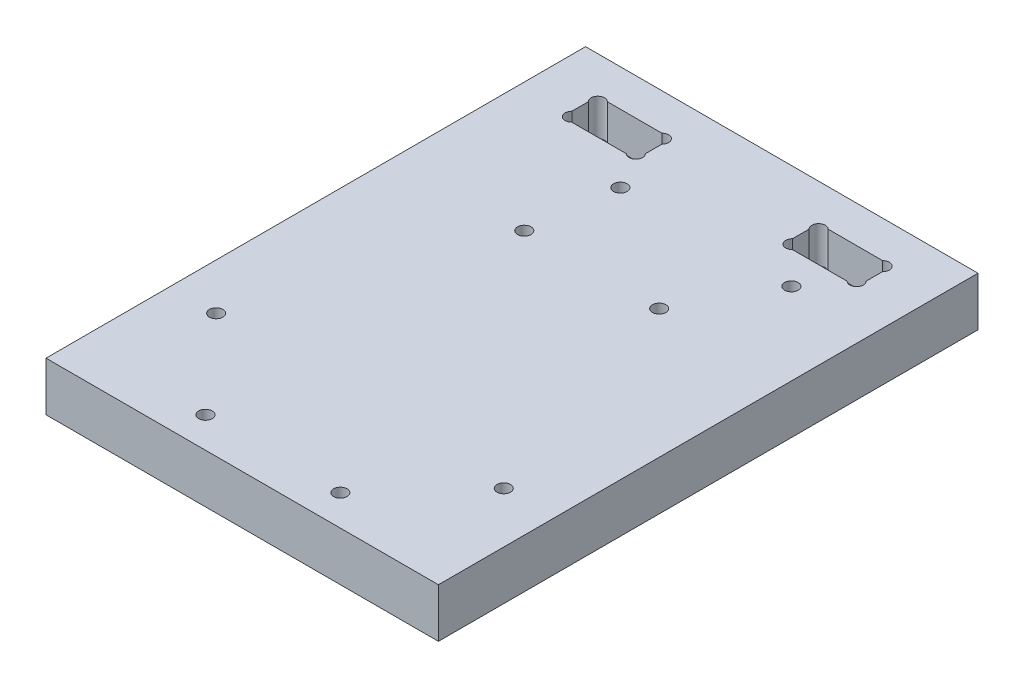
ISO-10303-21;
HEADER;
FILE_DESCRIPTION(('STEP AP214'),'2;1');
FILE_NAME('part.step','',(''),(''),'','','');
FILE_SCHEMA(('AUTOMOTIVE_DESIGN { 1 0 10303 214 1 1 1 1 }'));
ENDSEC;
DATA;
#1=APPLICATION_CONTEXT('core data for automotive mechanical design processes');
#2=APPLICATION_PROTOCOL_DEFINITION('international standard','automotive_design',2000,#1);
#3=PRODUCT_CONTEXT('',#1,'mechanical');
#4=PRODUCT('Part','Part','',(#3));
#5=PRODUCT_RELATED_PRODUCT_CATEGORY('part','',(#4));
#6=PRODUCT_DEFINITION_FORMATION('','',#4);
#7=PRODUCT_DEFINITION_CONTEXT('part definition',#1,'design');
#8=PRODUCT_DEFINITION('design','',#6,#7);
#9=PRODUCT_DEFINITION_SHAPE('','',#8);
#10=(LENGTH_UNIT() NAMED_UNIT(*) SI_UNIT(.MILLI.,.METRE.));
#11=(NAMED_UNIT(*) PLANE_ANGLE_UNIT() SI_UNIT($,.RADIAN.));
#12=(NAMED_UNIT(*) SI_UNIT($,.STERADIAN.) SOLID_ANGLE_UNIT());
#13=UNCERTAINTY_MEASURE_WITH_UNIT(LENGTH_MEASURE(1.E-05),#10,'distance_accuracy_value','');
#14=(GEOMETRIC_REPRESENTATION_CONTEXT(3) GLOBAL_UNCERTAINTY_ASSIGNED_CONTEXT((#13)) GLOBAL_UNIT_ASSIGNED_CONTEXT((#10,
#11,#12)) REPRESENTATION_CONTEXT('',''));
#15=CARTESIAN_POINT('',(0.,0.,0.));
#16=DIRECTION('',(0.,0.,1.));
#17=DIRECTION('',(1.,0.,0.));
#18=AXIS2_PLACEMENT_3D('',#15,#16,#17);
#19=CARTESIAN_POINT('',(23.2221825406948,8.,-32.9778174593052));
#20=DIRECTION('',(0.,-1.,0.));
#21=DIRECTION('',(0.,0.,-1.));
#22=AXIS2_PLACEMENT_3D('',#19,#20,#21);
#23=CYLINDRICAL_SURFACE('',#22,1.09999999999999);
#24=DIRECTION('',(0.,-1.,0.));
#25=VECTOR('',#24,1.);
#26=CARTESIAN_POINT('',(24.,8.,-33.7556349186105));
#27=LINE('',#26,#25);
#28=CARTESIAN_POINT('',(24.,8.,-33.7556349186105));
#29=VERTEX_POINT('',#28);
#30=CARTESIAN_POINT('',(24.,2.,-33.7556349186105));
#31=VERTEX_POINT('',#30);
#32=EDGE_CURVE('E454',#29,#31,#27,.T.);
#33=ORIENTED_EDGE('',*,*,#32,.T.);
#34=CARTESIAN_POINT('',(23.2221825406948,2.,-32.9778174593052));
#35=DIRECTION('',(0.,-1.,0.));
#36=DIRECTION('',(0.,0.,-1.));
#37=AXIS2_PLACEMENT_3D('',#34,#35,#36);
#38=CIRCLE('',#37,1.09999999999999);
#39=CARTESIAN_POINT('',(22.4443650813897,2.,-32.2));
#40=VERTEX_POINT('',#39);
#41=EDGE_CURVE('E271',#31,#40,#38,.T.);
#42=ORIENTED_EDGE('',*,*,#41,.T.);
#43=DIRECTION('',(0.,-1.,0.));
#44=VECTOR('',#43,1.);
#45=CARTESIAN_POINT('',(22.4443650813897,8.,-32.2));
#46=LINE('',#45,#44);
#47=CARTESIAN_POINT('',(22.4443650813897,8.,-32.2));
#48=VERTEX_POINT('',#47);
#49=EDGE_CURVE('E433',#48,#40,#46,.T.);
#50=ORIENTED_EDGE('',*,*,#49,.F.);
#51=CARTESIAN_POINT('',(23.2221825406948,8.,-32.9778174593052));
#52=DIRECTION('',(0.,1.,0.));
#53=DIRECTION('',(0.,0.,1.));
#54=AXIS2_PLACEMENT_3D('',#51,#52,#53);
#55=CIRCLE('',#54,1.09999999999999);
#56=EDGE_CURVE('E416',#48,#29,#55,.T.);
#57=ORIENTED_EDGE('',*,*,#56,.T.);
#58=EDGE_LOOP('',(#33,#42,#50,#57));
#59=FACE_BOUND('',#58,.T.);
#60=ADVANCED_FACE('F33',(#59),#23,.F.);
#61=CARTESIAN_POINT('',(24.,8.,-36.4443650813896));
#62=DIRECTION('',(-1.,0.,0.));
#63=DIRECTION('',(0.,0.,1.));
#64=AXIS2_PLACEMENT_3D('',#61,#62,#63);
#65=PLANE('',#64);
#66=DIRECTION('',(0.,-1.,0.));
#67=VECTOR('',#66,1.);
#68=CARTESIAN_POINT('',(24.,8.,-36.4443650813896));
#69=LINE('',#68,#67);
#70=CARTESIAN_POINT('',(24.,8.,-36.4443650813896));
#71=VERTEX_POINT('',#70);
#72=CARTESIAN_POINT('',(24.,2.,-36.4443650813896));
#73=VERTEX_POINT('',#72);
#74=EDGE_CURVE('E451',#71,#73,#69,.T.);
#75=ORIENTED_EDGE('',*,*,#74,.T.);
#76=DIRECTION('',(0.,0.,1.));
#77=VECTOR('',#76,1.);
#78=CARTESIAN_POINT('',(24.,2.,-36.4443650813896));
#79=LINE('',#78,#77);
#80=EDGE_CURVE('E268',#73,#31,#79,.T.);
#81=ORIENTED_EDGE('',*,*,#80,.T.);
#82=ORIENTED_EDGE('',*,*,#32,.F.);
#83=DIRECTION('',(0.,0.,-1.));
#84=VECTOR('',#83,1.);
#85=CARTESIAN_POINT('',(24.,8.,-36.4443650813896));
#86=LINE('',#85,#84);
#87=EDGE_CURVE('E418',#29,#71,#86,.T.);
#88=ORIENTED_EDGE('',*,*,#87,.T.);
#89=EDGE_LOOP('',(#75,#81,#82,#88));
#90=FACE_BOUND('',#89,.T.);
#91=ADVANCED_FACE('F533',(#90),#65,.T.);
#92=CARTESIAN_POINT('',(23.2221825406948,8.,-37.2221825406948));
#93=DIRECTION('',(0.,-1.,0.));
#94=DIRECTION('',(0.,0.,-1.));
#95=AXIS2_PLACEMENT_3D('',#92,#93,#94);
#96=CYLINDRICAL_SURFACE('',#95,1.09999999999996);
#97=DIRECTION('',(0.,-1.,0.));
#98=VECTOR('',#97,1.);
#99=CARTESIAN_POINT('',(22.4443650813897,8.,-38.));
#100=LINE('',#99,#98);
#101=CARTESIAN_POINT('',(22.4443650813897,8.,-38.));
#102=VERTEX_POINT('',#101);
#103=CARTESIAN_POINT('',(22.4443650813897,2.,-38.));
#104=VERTEX_POINT('',#103);
#105=EDGE_CURVE('E448',#102,#104,#100,.T.);
#106=ORIENTED_EDGE('',*,*,#105,.T.);
#107=CARTESIAN_POINT('',(23.2221825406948,2.,-37.2221825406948));
#108=DIRECTION('',(0.,-1.,0.));
#109=DIRECTION('',(0.,0.,-1.));
#110=AXIS2_PLACEMENT_3D('',#107,#108,#109);
#111=CIRCLE('',#110,1.09999999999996);
#112=EDGE_CURVE('E265',#104,#73,#111,.T.);
#113=ORIENTED_EDGE('',*,*,#112,.T.);
#114=ORIENTED_EDGE('',*,*,#74,.F.);
#115=CARTESIAN_POINT('',(23.2221825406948,8.,-37.2221825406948));
#116=DIRECTION('',(0.,1.,0.));
#117=DIRECTION('',(0.,0.,-1.));
#118=AXIS2_PLACEMENT_3D('',#115,#116,#117);
#119=CIRCLE('',#118,1.09999999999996);
#120=EDGE_CURVE('E420',#71,#102,#119,.T.);
#121=ORIENTED_EDGE('',*,*,#120,.T.);
#122=EDGE_LOOP('',(#106,#113,#114,#121));
#123=FACE_BOUND('',#122,.T.);
#124=ADVANCED_FACE('F539',(#123),#96,.F.);
#125=CARTESIAN_POINT('',(13.5556349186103,8.,-38.));
#126=DIRECTION('',(0.,0.,1.));
#127=DIRECTION('',(1.,0.,0.));
#128=AXIS2_PLACEMENT_3D('',#125,#126,#127);
#129=PLANE('',#128);
#130=DIRECTION('',(0.,-1.,0.));
#131=VECTOR('',#130,1.);
#132=CARTESIAN_POINT('',(13.5556349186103,8.,-38.));
#133=LINE('',#132,#131);
#134=CARTESIAN_POINT('',(13.5556349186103,8.,-38.));
#135=VERTEX_POINT('',#134);
#136=CARTESIAN_POINT('',(13.5556349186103,2.,-38.));
#137=VERTEX_POINT('',#136);
#138=EDGE_CURVE('E445',#135,#137,#133,.T.);
#139=ORIENTED_EDGE('',*,*,#138,.T.);
#140=DIRECTION('',(1.,0.,0.));
#141=VECTOR('',#140,1.);
#142=CARTESIAN_POINT('',(13.5556349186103,2.,-38.));
#143=LINE('',#142,#141);
#144=EDGE_CURVE('E262',#137,#104,#143,.T.);
#145=ORIENTED_EDGE('',*,*,#144,.T.);
#146=ORIENTED_EDGE('',*,*,#105,.F.);
#147=DIRECTION('',(-1.,0.,0.));
#148=VECTOR('',#147,1.);
#149=CARTESIAN_POINT('',(13.5556349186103,8.,-38.));
#150=LINE('',#149,#148);
#151=EDGE_CURVE('E422',#102,#135,#150,.T.);
#152=ORIENTED_EDGE('',*,*,#151,.T.);
#153=EDGE_LOOP('',(#139,#145,#146,#152));
#154=FACE_BOUND('',#153,.T.);
#155=ADVANCED_FACE('F590',(#154),#129,.T.);
#156=CARTESIAN_POINT('',(12.7778174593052,8.,-37.2221825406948));
#157=DIRECTION('',(0.,-1.,0.));
#158=DIRECTION('',(0.,0.,-1.));
#159=AXIS2_PLACEMENT_3D('',#156,#157,#158);
#160=CYLINDRICAL_SURFACE('',#159,1.09999999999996);
#161=DIRECTION('',(0.,-1.,0.));
#162=VECTOR('',#161,1.);
#163=CARTESIAN_POINT('',(12.,8.,-36.4443650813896));
#164=LINE('',#163,#162);
#165=CARTESIAN_POINT('',(12.,8.,-36.4443650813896));
#166=VERTEX_POINT('',#165);
#167=CARTESIAN_POINT('',(12.,2.,-36.4443650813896));
#168=VERTEX_POINT('',#167);
#169=EDGE_CURVE('E442',#166,#168,#164,.T.);
#170=ORIENTED_EDGE('',*,*,#169,.T.);
#171=CARTESIAN_POINT('',(12.7778174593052,2.,-37.2221825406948));
#172=DIRECTION('',(0.,-1.,0.));
#173=DIRECTION('',(0.,0.,-1.));
#174=AXIS2_PLACEMENT_3D('',#171,#172,#173);
#175=CIRCLE('',#174,1.09999999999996);
#176=EDGE_CURVE('E259',#168,#137,#175,.T.);
#177=ORIENTED_EDGE('',*,*,#176,.T.);
#178=ORIENTED_EDGE('',*,*,#138,.F.);
#179=CARTESIAN_POINT('',(12.7778174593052,8.,-37.2221825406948));
#180=DIRECTION('',(0.,1.,0.));
#181=DIRECTION('',(0.,0.,1.));
#182=AXIS2_PLACEMENT_3D('',#179,#180,#181);
#183=CIRCLE('',#182,1.09999999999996);
#184=EDGE_CURVE('E424',#135,#166,#183,.T.);
#185=ORIENTED_EDGE('',*,*,#184,.T.);
#186=EDGE_LOOP('',(#170,#177,#178,#185));
#187=FACE_BOUND('',#186,.T.);
#188=ADVANCED_FACE('F594',(#187),#160,.F.);
#189=CARTESIAN_POINT('',(12.,8.,-36.4443650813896));
#190=DIRECTION('',(1.,0.,0.));
#191=DIRECTION('',(0.,0.,-1.));
#192=AXIS2_PLACEMENT_3D('',#189,#190,#191);
#193=PLANE('',#192);
#194=DIRECTION('',(0.,-1.,0.));
#195=VECTOR('',#194,1.);
#196=CARTESIAN_POINT('',(12.,8.,-33.7556349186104));
#197=LINE('',#196,#195);
#198=CARTESIAN_POINT('',(12.,8.,-33.7556349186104));
#199=VERTEX_POINT('',#198);
#200=CARTESIAN_POINT('',(12.,2.,-33.7556349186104));
#201=VERTEX_POINT('',#200);
#202=EDGE_CURVE('E439',#199,#201,#197,.T.);
#203=ORIENTED_EDGE('',*,*,#202,.T.);
#204=DIRECTION('',(0.,0.,-1.));
#205=VECTOR('',#204,1.);
#206=CARTESIAN_POINT('',(12.,2.,-36.4443650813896));
#207=LINE('',#206,#205);
#208=EDGE_CURVE('E256',#201,#168,#207,.T.);
#209=ORIENTED_EDGE('',*,*,#208,.T.);
#210=ORIENTED_EDGE('',*,*,#169,.F.);
#211=DIRECTION('',(0.,0.,1.));
#212=VECTOR('',#211,1.);
#213=CARTESIAN_POINT('',(12.,8.,-36.4443650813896));
#214=LINE('',#213,#212);
#215=EDGE_CURVE('E426',#166,#199,#214,.T.);
#216=ORIENTED_EDGE('',*,*,#215,.T.);
#217=EDGE_LOOP('',(#203,#209,#210,#216));
#218=FACE_BOUND('',#217,.T.);
#219=ADVANCED_FACE('F600',(#218),#193,.T.);
#220=CARTESIAN_POINT('',(12.7778174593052,8.,-32.9778174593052));
#221=DIRECTION('',(0.,-1.,0.));
#222=DIRECTION('',(0.,0.,-1.));
#223=AXIS2_PLACEMENT_3D('',#220,#221,#222);
#224=CYLINDRICAL_SURFACE('',#223,1.09999999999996);
#225=DIRECTION('',(0.,-1.,0.));
#226=VECTOR('',#225,1.);
#227=CARTESIAN_POINT('',(13.5556349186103,8.,-32.2));
#228=LINE('',#227,#226);
#229=CARTESIAN_POINT('',(13.5556349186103,8.,-32.2));
#230=VERTEX_POINT('',#229);
#231=CARTESIAN_POINT('',(13.5556349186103,2.,-32.2));
#232=VERTEX_POINT('',#231);
#233=EDGE_CURVE('E436',#230,#232,#228,.T.);
#234=ORIENTED_EDGE('',*,*,#233,.T.);
#235=CARTESIAN_POINT('',(12.7778174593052,2.,-32.9778174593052));
#236=DIRECTION('',(0.,-1.,0.));
#237=DIRECTION('',(0.,0.,-1.));
#238=AXIS2_PLACEMENT_3D('',#235,#236,#237);
#239=CIRCLE('',#238,1.09999999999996);
#240=EDGE_CURVE('E56',#232,#201,#239,.T.);
#241=ORIENTED_EDGE('',*,*,#240,.T.);
#242=ORIENTED_EDGE('',*,*,#202,.F.);
#243=CARTESIAN_POINT('',(12.7778174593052,8.,-32.9778174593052));
#244=DIRECTION('',(0.,1.,0.));
#245=DIRECTION('',(0.,0.,-1.));
#246=AXIS2_PLACEMENT_3D('',#243,#244,#245);
#247=CIRCLE('',#246,1.09999999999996);
#248=EDGE_CURVE('E428',#199,#230,#247,.T.);
#249=ORIENTED_EDGE('',*,*,#248,.T.);
#250=EDGE_LOOP('',(#234,#241,#242,#249));
#251=FACE_BOUND('',#250,.T.);
#252=ADVANCED_FACE('F602',(#251),#224,.F.);
#253=CARTESIAN_POINT('',(13.5556349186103,8.,-32.2));
#254=DIRECTION('',(0.,0.,-1.));
#255=DIRECTION('',(-1.,0.,0.));
#256=AXIS2_PLACEMENT_3D('',#253,#254,#255);
#257=PLANE('',#256);
#258=ORIENTED_EDGE('',*,*,#49,.T.);
#259=DIRECTION('',(-1.,0.,0.));
#260=VECTOR('',#259,1.);
#261=CARTESIAN_POINT('',(13.5556349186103,2.,-32.2));
#262=LINE('',#261,#260);
#263=EDGE_CURVE('E11',#40,#232,#262,.T.);
#264=ORIENTED_EDGE('',*,*,#263,.T.);
#265=ORIENTED_EDGE('',*,*,#233,.F.);
#266=DIRECTION('',(1.,0.,0.));
#267=VECTOR('',#266,1.);
#268=CARTESIAN_POINT('',(13.5556349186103,8.,-32.2));
#269=LINE('',#268,#267);
#270=EDGE_CURVE('E431',#230,#48,#269,.T.);
#271=ORIENTED_EDGE('',*,*,#270,.T.);
#272=EDGE_LOOP('',(#258,#264,#265,#271));
#273=FACE_BOUND('',#272,.T.);
#274=ADVANCED_FACE('F604',(#273),#257,.T.);
#275=CARTESIAN_POINT('',(-12.7778174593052,8.,-37.2221825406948));
#276=DIRECTION('',(0.,-1.,0.));
#277=DIRECTION('',(0.,0.,-1.));
#278=AXIS2_PLACEMENT_3D('',#275,#276,#277);
#279=CYLINDRICAL_SURFACE('',#278,1.09999999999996);
#280=DIRECTION('',(0.,-1.,0.));
#281=VECTOR('',#280,1.);
#282=CARTESIAN_POINT('',(-13.5556349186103,8.,-38.));
#283=LINE('',#282,#281);
#284=CARTESIAN_POINT('',(-13.5556349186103,8.,-38.));
#285=VERTEX_POINT('',#284);
#286=CARTESIAN_POINT('',(-13.5556349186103,2.,-38.));
#287=VERTEX_POINT('',#286);
#288=EDGE_CURVE('E413',#285,#287,#283,.T.);
#289=ORIENTED_EDGE('',*,*,#288,.T.);
#290=CARTESIAN_POINT('',(-12.7778174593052,2.,-37.2221825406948));
#291=DIRECTION('',(0.,-1.,0.));
#292=DIRECTION('',(0.,0.,-1.));
#293=AXIS2_PLACEMENT_3D('',#290,#291,#292);
#294=CIRCLE('',#293,1.09999999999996);
#295=CARTESIAN_POINT('',(-12.,2.,-36.4443650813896));
#296=VERTEX_POINT('',#295);
#297=EDGE_CURVE('E324',#287,#296,#294,.T.);
#298=ORIENTED_EDGE('',*,*,#297,.T.);
#299=DIRECTION('',(0.,-1.,0.));
#300=VECTOR('',#299,1.);
#301=CARTESIAN_POINT('',(-12.,8.,-36.4443650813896));
#302=LINE('',#301,#300);
#303=CARTESIAN_POINT('',(-12.,8.,-36.4443650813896));
#304=VERTEX_POINT('',#303);
#305=EDGE_CURVE('E392',#304,#296,#302,.T.);
#306=ORIENTED_EDGE('',*,*,#305,.F.);
#307=CARTESIAN_POINT('',(-12.7778174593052,8.,-37.2221825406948));
#308=DIRECTION('',(0.,1.,0.));
#309=DIRECTION('',(0.,0.,-1.));
#310=AXIS2_PLACEMENT_3D('',#307,#308,#309);
#311=CIRCLE('',#310,1.09999999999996);
#312=EDGE_CURVE('E373',#304,#285,#311,.T.);
#313=ORIENTED_EDGE('',*,*,#312,.T.);
#314=EDGE_LOOP('',(#289,#298,#306,#313));
#315=FACE_BOUND('',#314,.T.);
#316=ADVANCED_FACE('F503',(#315),#279,.F.);
#317=CARTESIAN_POINT('',(-13.5556349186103,8.,-38.));
#318=DIRECTION('',(0.,0.,1.));
#319=DIRECTION('',(1.,0.,0.));
#320=AXIS2_PLACEMENT_3D('',#317,#318,#319);
#321=PLANE('',#320);
#322=DIRECTION('',(0.,-1.,0.));
#323=VECTOR('',#322,1.);
#324=CARTESIAN_POINT('',(-22.4443650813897,8.,-38.));
#325=LINE('',#324,#323);
#326=CARTESIAN_POINT('',(-22.4443650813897,8.,-38.));
#327=VERTEX_POINT('',#326);
#328=CARTESIAN_POINT('',(-22.4443650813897,2.,-38.));
#329=VERTEX_POINT('',#328);
#330=EDGE_CURVE('E410',#327,#329,#325,.T.);
#331=ORIENTED_EDGE('',*,*,#330,.T.);
#332=DIRECTION('',(1.,0.,0.));
#333=VECTOR('',#332,1.);
#334=CARTESIAN_POINT('',(-13.5556349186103,2.,-38.));
#335=LINE('',#334,#333);
#336=EDGE_CURVE('E321',#329,#287,#335,.T.);
#337=ORIENTED_EDGE('',*,*,#336,.T.);
#338=ORIENTED_EDGE('',*,*,#288,.F.);
#339=DIRECTION('',(-1.,0.,0.));
#340=VECTOR('',#339,1.);
#341=CARTESIAN_POINT('',(-13.5556349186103,8.,-38.));
#342=LINE('',#341,#340);
#343=EDGE_CURVE('E377',#285,#327,#342,.T.);
#344=ORIENTED_EDGE('',*,*,#343,.T.);
#345=EDGE_LOOP('',(#331,#337,#338,#344));
#346=FACE_BOUND('',#345,.T.);
#347=ADVANCED_FACE('F508',(#346),#321,.T.);
#348=CARTESIAN_POINT('',(-23.2221825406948,8.,-37.2221825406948));
#349=DIRECTION('',(0.,-1.,0.));
#350=DIRECTION('',(0.,0.,-1.));
#351=AXIS2_PLACEMENT_3D('',#348,#349,#350);
#352=CYLINDRICAL_SURFACE('',#351,1.09999999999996);
#353=DIRECTION('',(0.,-1.,0.));
#354=VECTOR('',#353,1.);
#355=CARTESIAN_POINT('',(-24.,8.,-36.4443650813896));
#356=LINE('',#355,#354);
#357=CARTESIAN_POINT('',(-24.,8.,-36.4443650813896));
#358=VERTEX_POINT('',#357);
#359=CARTESIAN_POINT('',(-24.,2.,-36.4443650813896));
#360=VERTEX_POINT('',#359);
#361=EDGE_CURVE('E407',#358,#360,#356,.T.);
#362=ORIENTED_EDGE('',*,*,#361,.T.);
#363=CARTESIAN_POINT('',(-23.2221825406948,2.,-37.2221825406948));
#364=DIRECTION('',(0.,-1.,0.));
#365=DIRECTION('',(0.,0.,-1.));
#366=AXIS2_PLACEMENT_3D('',#363,#364,#365);
#367=CIRCLE('',#366,1.09999999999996);
#368=EDGE_CURVE('E318',#360,#329,#367,.T.);
#369=ORIENTED_EDGE('',*,*,#368,.T.);
#370=ORIENTED_EDGE('',*,*,#330,.F.);
#371=CARTESIAN_POINT('',(-23.2221825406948,8.,-37.2221825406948));
#372=DIRECTION('',(0.,1.,0.));
#373=DIRECTION('',(0.,0.,1.));
#374=AXIS2_PLACEMENT_3D('',#371,#372,#373);
#375=CIRCLE('',#374,1.09999999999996);
#376=EDGE_CURVE('E379',#327,#358,#375,.T.);
#377=ORIENTED_EDGE('',*,*,#376,.T.);
#378=EDGE_LOOP('',(#362,#369,#370,#377));
#379=FACE_BOUND('',#378,.T.);
#380=ADVANCED_FACE('F512',(#379),#352,.F.);
#381=CARTESIAN_POINT('',(-24.,8.,-36.4443650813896));
#382=DIRECTION('',(1.,0.,0.));
#383=DIRECTION('',(0.,0.,-1.));
#384=AXIS2_PLACEMENT_3D('',#381,#382,#383);
#385=PLANE('',#384);
#386=DIRECTION('',(0.,-1.,0.));
#387=VECTOR('',#386,1.);
#388=CARTESIAN_POINT('',(-24.,8.,-33.7556349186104));
#389=LINE('',#388,#387);
#390=CARTESIAN_POINT('',(-24.,8.,-33.7556349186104));
#391=VERTEX_POINT('',#390);
#392=CARTESIAN_POINT('',(-24.,2.,-33.7556349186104));
#393=VERTEX_POINT('',#392);
#394=EDGE_CURVE('E404',#391,#393,#389,.T.);
#395=ORIENTED_EDGE('',*,*,#394,.T.);
#396=DIRECTION('',(0.,0.,-1.));
#397=VECTOR('',#396,1.);
#398=CARTESIAN_POINT('',(-24.,2.,-36.4443650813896));
#399=LINE('',#398,#397);
#400=EDGE_CURVE('E315',#393,#360,#399,.T.);
#401=ORIENTED_EDGE('',*,*,#400,.T.);
#402=ORIENTED_EDGE('',*,*,#361,.F.);
#403=DIRECTION('',(0.,0.,1.));
#404=VECTOR('',#403,1.);
#405=CARTESIAN_POINT('',(-24.,8.,-36.4443650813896));
#406=LINE('',#405,#404);
#407=EDGE_CURVE('E381',#358,#391,#406,.T.);
#408=ORIENTED_EDGE('',*,*,#407,.T.);
#409=EDGE_LOOP('',(#395,#401,#402,#408));
#410=FACE_BOUND('',#409,.T.);
#411=ADVANCED_FACE('F518',(#410),#385,.T.);
#412=CARTESIAN_POINT('',(-23.2221825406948,8.,-32.9778174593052));
#413=DIRECTION('',(0.,-1.,0.));
#414=DIRECTION('',(0.,0.,-1.));
#415=AXIS2_PLACEMENT_3D('',#412,#413,#414);
#416=CYLINDRICAL_SURFACE('',#415,1.09999999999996);
#417=DIRECTION('',(0.,-1.,0.));
#418=VECTOR('',#417,1.);
#419=CARTESIAN_POINT('',(-22.4443650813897,8.,-32.2));
#420=LINE('',#419,#418);
#421=CARTESIAN_POINT('',(-22.4443650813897,8.,-32.2));
#422=VERTEX_POINT('',#421);
#423=CARTESIAN_POINT('',(-22.4443650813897,2.,-32.2));
#424=VERTEX_POINT('',#423);
#425=EDGE_CURVE('E401',#422,#424,#420,.T.);
#426=ORIENTED_EDGE('',*,*,#425,.T.);
#427=CARTESIAN_POINT('',(-23.2221825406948,2.,-32.9778174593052));
#428=DIRECTION('',(0.,-1.,0.));
#429=DIRECTION('',(0.,0.,-1.));
#430=AXIS2_PLACEMENT_3D('',#427,#428,#429);
#431=CIRCLE('',#430,1.09999999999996);
#432=EDGE_CURVE('E312',#424,#393,#431,.T.);
#433=ORIENTED_EDGE('',*,*,#432,.T.);
#434=ORIENTED_EDGE('',*,*,#394,.F.);
#435=CARTESIAN_POINT('',(-23.2221825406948,8.,-32.9778174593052));
#436=DIRECTION('',(0.,1.,0.));
#437=DIRECTION('',(0.,0.,-1.));
#438=AXIS2_PLACEMENT_3D('',#435,#436,#437);
#439=CIRCLE('',#438,1.09999999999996);
#440=EDGE_CURVE('E383',#391,#422,#439,.T.);
#441=ORIENTED_EDGE('',*,*,#440,.T.);
#442=EDGE_LOOP('',(#426,#433,#434,#441));
#443=FACE_BOUND('',#442,.T.);
#444=ADVANCED_FACE('F520',(#443),#416,.F.);
#445=CARTESIAN_POINT('',(-13.5556349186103,8.,-32.2));
#446=DIRECTION('',(0.,0.,-1.));
#447=DIRECTION('',(-1.,0.,0.));
#448=AXIS2_PLACEMENT_3D('',#445,#446,#447);
#449=PLANE('',#448);
#450=DIRECTION('',(0.,-1.,0.));
#451=VECTOR('',#450,1.);
#452=CARTESIAN_POINT('',(-13.5556349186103,8.,-32.2));
#453=LINE('',#452,#451);
#454=CARTESIAN_POINT('',(-13.5556349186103,8.,-32.2));
#455=VERTEX_POINT('',#454);
#456=CARTESIAN_POINT('',(-13.5556349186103,2.,-32.2));
#457=VERTEX_POINT('',#456);
#458=EDGE_CURVE('E398',#455,#457,#453,.T.);
#459=ORIENTED_EDGE('',*,*,#458,.T.);
#460=DIRECTION('',(-1.,0.,0.));
#461=VECTOR('',#460,1.);
#462=CARTESIAN_POINT('',(-13.5556349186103,2.,-32.2));
#463=LINE('',#462,#461);
#464=EDGE_CURVE('E309',#457,#424,#463,.T.);
#465=ORIENTED_EDGE('',*,*,#464,.T.);
#466=ORIENTED_EDGE('',*,*,#425,.F.);
#467=DIRECTION('',(1.,0.,0.));
#468=VECTOR('',#467,1.);
#469=CARTESIAN_POINT('',(-13.5556349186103,8.,-32.2));
#470=LINE('',#469,#468);
#471=EDGE_CURVE('E385',#422,#455,#470,.T.);
#472=ORIENTED_EDGE('',*,*,#471,.T.);
#473=EDGE_LOOP('',(#459,#465,#466,#472));
#474=FACE_BOUND('',#473,.T.);
#475=ADVANCED_FACE('F523',(#474),#449,.T.);
#476=CARTESIAN_POINT('',(-12.7778174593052,8.,-32.9778174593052));
#477=DIRECTION('',(0.,-1.,0.));
#478=DIRECTION('',(0.,0.,-1.));
#479=AXIS2_PLACEMENT_3D('',#476,#477,#478);
#480=CYLINDRICAL_SURFACE('',#479,1.09999999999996);
#481=DIRECTION('',(0.,-1.,0.));
#482=VECTOR('',#481,1.);
#483=CARTESIAN_POINT('',(-12.,8.,-33.7556349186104));
#484=LINE('',#483,#482);
#485=CARTESIAN_POINT('',(-12.,8.,-33.7556349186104));
#486=VERTEX_POINT('',#485);
#487=CARTESIAN_POINT('',(-12.,2.,-33.7556349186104));
#488=VERTEX_POINT('',#487);
#489=EDGE_CURVE('E395',#486,#488,#484,.T.);
#490=ORIENTED_EDGE('',*,*,#489,.T.);
#491=CARTESIAN_POINT('',(-12.7778174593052,2.,-32.9778174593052));
#492=DIRECTION('',(0.,-1.,0.));
#493=DIRECTION('',(0.,0.,-1.));
#494=AXIS2_PLACEMENT_3D('',#491,#492,#493);
#495=CIRCLE('',#494,1.09999999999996);
#496=EDGE_CURVE('E300',#488,#457,#495,.T.);
#497=ORIENTED_EDGE('',*,*,#496,.T.);
#498=ORIENTED_EDGE('',*,*,#458,.F.);
#499=CARTESIAN_POINT('',(-12.7778174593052,8.,-32.9778174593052));
#500=DIRECTION('',(0.,1.,0.));
#501=DIRECTION('',(0.,0.,1.));
#502=AXIS2_PLACEMENT_3D('',#499,#500,#501);
#503=CIRCLE('',#502,1.09999999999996);
#504=EDGE_CURVE('E387',#455,#486,#503,.T.);
#505=ORIENTED_EDGE('',*,*,#504,.T.);
#506=EDGE_LOOP('',(#490,#497,#498,#505));
#507=FACE_BOUND('',#506,.T.);
#508=ADVANCED_FACE('F492',(#507),#480,.F.);
#509=CARTESIAN_POINT('',(-12.,8.,-36.4443650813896));
#510=DIRECTION('',(-1.,0.,0.));
#511=DIRECTION('',(0.,0.,1.));
#512=AXIS2_PLACEMENT_3D('',#509,#510,#511);
#513=PLANE('',#512);
#514=ORIENTED_EDGE('',*,*,#305,.T.);
#515=DIRECTION('',(0.,0.,1.));
#516=VECTOR('',#515,1.);
#517=CARTESIAN_POINT('',(-12.,2.,-36.4443650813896));
#518=LINE('',#517,#516);
#519=EDGE_CURVE('E41',#296,#488,#518,.T.);
#520=ORIENTED_EDGE('',*,*,#519,.T.);
#521=ORIENTED_EDGE('',*,*,#489,.F.);
#522=DIRECTION('',(0.,0.,-1.));
#523=VECTOR('',#522,1.);
#524=CARTESIAN_POINT('',(-12.,8.,-36.4443650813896));
#525=LINE('',#524,#523);
#526=EDGE_CURVE('E390',#486,#304,#525,.T.);
#527=ORIENTED_EDGE('',*,*,#526,.T.);
#528=EDGE_LOOP('',(#514,#520,#521,#527));
#529=FACE_BOUND('',#528,.T.);
#530=ADVANCED_FACE('F488',(#529),#513,.T.);
#531=CARTESIAN_POINT('',(0.,8.,0.));
#532=DIRECTION('',(0.,1.,0.));
#533=DIRECTION('',(0.,0.,1.));
#534=AXIS2_PLACEMENT_3D('',#531,#532,#533);
#535=PLANE('',#534);
#536=CARTESIAN_POINT('',(11.,8.,-13.));
#537=DIRECTION('',(0.,1.,0.));
#538=DIRECTION('',(0.,0.,1.));
#539=AXIS2_PLACEMENT_3D('',#536,#537,#538);
#540=CIRCLE('',#539,1.1);
#541=CARTESIAN_POINT('',(11.,8.,-11.9));
#542=VERTEX_POINT('',#541);
#543=EDGE_CURVE('E334',#542,#542,#540,.T.);
#544=ORIENTED_EDGE('',*,*,#543,.F.);
#545=EDGE_LOOP('',(#544));
#546=FACE_BOUND('',#545,.T.);
#547=CARTESIAN_POINT('',(-11.,8.,39.));
#548=DIRECTION('',(0.,1.,0.));
#549=DIRECTION('',(0.,0.,1.));
#550=AXIS2_PLACEMENT_3D('',#547,#548,#549);
#551=CIRCLE('',#550,1.1);
#552=CARTESIAN_POINT('',(-11.,8.,40.1));
#553=VERTEX_POINT('',#552);
#554=EDGE_CURVE('E346',#553,#553,#551,.T.);
#555=ORIENTED_EDGE('',*,*,#554,.F.);
#556=EDGE_LOOP('',(#555));
#557=FACE_BOUND('',#556,.T.);
#558=CARTESIAN_POINT('',(18.6384808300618,8.,-26.9225175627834));
#559=DIRECTION('',(0.,1.,0.));
#560=DIRECTION('',(0.,0.,1.));
#561=AXIS2_PLACEMENT_3D('',#558,#559,#560);
#562=CIRCLE('',#561,1.1);
#563=CARTESIAN_POINT('',(18.6384808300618,8.,-25.8225175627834));
#564=VERTEX_POINT('',#563);
#565=EDGE_CURVE('E358',#564,#564,#562,.T.);
#566=ORIENTED_EDGE('',*,*,#565,.F.);
#567=EDGE_LOOP('',(#566));
#568=FACE_BOUND('',#567,.T.);
#569=CARTESIAN_POINT('',(-24.4644524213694,8.,23.7872303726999));
#570=DIRECTION('',(0.,1.,0.));
#571=DIRECTION('',(0.,0.,1.));
#572=AXIS2_PLACEMENT_3D('',#569,#570,#571);
#573=CIRCLE('',#572,1.1);
#574=CARTESIAN_POINT('',(-24.4644524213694,8.,24.8872303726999));
#575=VERTEX_POINT('',#574);
#576=EDGE_CURVE('E370',#575,#575,#573,.T.);
#577=ORIENTED_EDGE('',*,*,#576,.F.);
#578=EDGE_LOOP('',(#577));
#579=FACE_BOUND('',#578,.T.);
#580=DIRECTION('',(0.,0.,-1.));
#581=VECTOR('',#580,1.);
#582=CARTESIAN_POINT('',(32.,8.,-44.));
#583=LINE('',#582,#581);
#584=CARTESIAN_POINT('',(32.,8.,44.));
#585=VERTEX_POINT('',#584);
#586=CARTESIAN_POINT('',(32.,8.,-44.));
#587=VERTEX_POINT('',#586);
#588=EDGE_CURVE('E458',#585,#587,#583,.T.);
#589=ORIENTED_EDGE('',*,*,#588,.T.);
#590=DIRECTION('',(-1.,0.,0.));
#591=VECTOR('',#590,1.);
#592=CARTESIAN_POINT('',(-32.,8.,-44.));
#593=LINE('',#592,#591);
#594=CARTESIAN_POINT('',(-32.,8.,-44.));
#595=VERTEX_POINT('',#594);
#596=EDGE_CURVE('E461',#587,#595,#593,.T.);
#597=ORIENTED_EDGE('',*,*,#596,.T.);
#598=DIRECTION('',(0.,0.,1.));
#599=VECTOR('',#598,1.);
#600=CARTESIAN_POINT('',(-32.,8.,-44.));
#601=LINE('',#600,#599);
#602=CARTESIAN_POINT('',(-32.,8.,44.));
#603=VERTEX_POINT('',#602);
#604=EDGE_CURVE('E464',#595,#603,#601,.T.);
#605=ORIENTED_EDGE('',*,*,#604,.T.);
#606=DIRECTION('',(1.,0.,0.));
#607=VECTOR('',#606,1.);
#608=CARTESIAN_POINT('',(-32.,8.,44.));
#609=LINE('',#608,#607);
#610=EDGE_CURVE('E466',#603,#585,#609,.T.);
#611=ORIENTED_EDGE('',*,*,#610,.T.);
#612=EDGE_LOOP('',(#589,#597,#605,#611));
#613=FACE_BOUND('',#612,.T.);
#614=ORIENTED_EDGE('',*,*,#87,.F.);
#615=ORIENTED_EDGE('',*,*,#56,.F.);
#616=ORIENTED_EDGE('',*,*,#270,.F.);
#617=ORIENTED_EDGE('',*,*,#248,.F.);
#618=ORIENTED_EDGE('',*,*,#215,.F.);
#619=ORIENTED_EDGE('',*,*,#184,.F.);
#620=ORIENTED_EDGE('',*,*,#151,.F.);
#621=ORIENTED_EDGE('',*,*,#120,.F.);
#622=EDGE_LOOP('',(#614,#615,#616,#617,#618,#619,#620,#621));
#623=FACE_BOUND('',#622,.T.);
#624=ORIENTED_EDGE('',*,*,#343,.F.);
#625=ORIENTED_EDGE('',*,*,#312,.F.);
#626=ORIENTED_EDGE('',*,*,#526,.F.);
#627=ORIENTED_EDGE('',*,*,#504,.F.);
#628=ORIENTED_EDGE('',*,*,#471,.F.);
#629=ORIENTED_EDGE('',*,*,#440,.F.);
#630=ORIENTED_EDGE('',*,*,#407,.F.);
#631=ORIENTED_EDGE('',*,*,#376,.F.);
#632=EDGE_LOOP('',(#624,#625,#626,#627,#628,#629,#630,#631));
#633=FACE_BOUND('',#632,.T.);
#634=CARTESIAN_POINT('',(-9.25168279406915,8.,-26.9225175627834));
#635=DIRECTION('',(0.,1.,0.));
#636=DIRECTION('',(0.,0.,1.));
#637=AXIS2_PLACEMENT_3D('',#634,#635,#636);
#638=CIRCLE('',#637,1.1);
#639=CARTESIAN_POINT('',(-9.25168279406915,8.,-25.8225175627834));
#640=VERTEX_POINT('',#639);
#641=EDGE_CURVE('E364',#640,#640,#638,.T.);
#642=ORIENTED_EDGE('',*,*,#641,.F.);
#643=EDGE_LOOP('',(#642));
#644=FACE_BOUND('',#643,.T.);
#645=CARTESIAN_POINT('',(23.7095759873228,8.,25.0550041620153));
#646=DIRECTION('',(0.,1.,0.));
#647=DIRECTION('',(0.,0.,1.));
#648=AXIS2_PLACEMENT_3D('',#645,#646,#647);
#649=CIRCLE('',#648,1.1);
#650=CARTESIAN_POINT('',(23.7095759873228,8.,26.1550041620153));
#651=VERTEX_POINT('',#650);
#652=EDGE_CURVE('E352',#651,#651,#649,.T.);
#653=ORIENTED_EDGE('',*,*,#652,.F.);
#654=EDGE_LOOP('',(#653));
#655=FACE_BOUND('',#654,.T.);
#656=CARTESIAN_POINT('',(11.,8.,39.));
#657=DIRECTION('',(0.,1.,0.));
#658=DIRECTION('',(0.,0.,-1.));
#659=AXIS2_PLACEMENT_3D('',#656,#657,#658);
#660=CIRCLE('',#659,1.1);
#661=CARTESIAN_POINT('',(11.,8.,37.9));
#662=VERTEX_POINT('',#661);
#663=EDGE_CURVE('E340',#662,#662,#660,.T.);
#664=ORIENTED_EDGE('',*,*,#663,.F.);
#665=EDGE_LOOP('',(#664));
#666=FACE_BOUND('',#665,.T.);
#667=CARTESIAN_POINT('',(-11.,8.,-13.));
#668=DIRECTION('',(0.,1.,0.));
#669=DIRECTION('',(0.,0.,-1.));
#670=AXIS2_PLACEMENT_3D('',#667,#668,#669);
#671=CIRCLE('',#670,1.1);
#672=CARTESIAN_POINT('',(-11.,8.,-14.1));
#673=VERTEX_POINT('',#672);
#674=EDGE_CURVE('E328',#673,#673,#671,.T.);
#675=ORIENTED_EDGE('',*,*,#674,.F.);
#676=EDGE_LOOP('',(#675));
#677=FACE_BOUND('',#676,.T.);
#678=ADVANCED_FACE('F500',(#546,#557,#568,#579,#613,#623,#633,#644,#655,#666,#677),#535,.T.);
#679=CARTESIAN_POINT('',(0.,0.,0.));
#680=DIRECTION('',(0.,1.,0.));
#681=DIRECTION('',(0.,0.,1.));
#682=AXIS2_PLACEMENT_3D('',#679,#680,#681);
#683=PLANE('',#682);
#684=DIRECTION('',(0.,0.,-1.));
#685=VECTOR('',#684,1.);
#686=CARTESIAN_POINT('',(9.00000000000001,0.,-29.6));
#687=LINE('',#686,#685);
#688=CARTESIAN_POINT('',(9.00000000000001,0.,-29.6));
#689=VERTEX_POINT('',#688);
#690=CARTESIAN_POINT('',(9.00000000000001,0.,-40.6));
#691=VERTEX_POINT('',#690);
#692=EDGE_CURVE('E246',#689,#691,#687,.T.);
#693=ORIENTED_EDGE('',*,*,#692,.F.);
#694=DIRECTION('',(-1.,0.,0.));
#695=VECTOR('',#694,1.);
#696=CARTESIAN_POINT('',(27.,0.,-29.6));
#697=LINE('',#696,#695);
#698=CARTESIAN_POINT('',(27.,0.,-29.6));
#699=VERTEX_POINT('',#698);
#700=EDGE_CURVE('E48',#699,#689,#697,.T.);
#701=ORIENTED_EDGE('',*,*,#700,.F.);
#702=DIRECTION('',(0.,0.,1.));
#703=VECTOR('',#702,1.);
#704=CARTESIAN_POINT('',(27.,0.,-29.6));
#705=LINE('',#704,#703);
#706=CARTESIAN_POINT('',(27.,0.,-40.6));
#707=VERTEX_POINT('',#706);
#708=EDGE_CURVE('E237',#707,#699,#705,.T.);
#709=ORIENTED_EDGE('',*,*,#708,.F.);
#710=DIRECTION('',(1.,0.,0.));
#711=VECTOR('',#710,1.);
#712=CARTESIAN_POINT('',(27.,0.,-40.6));
#713=LINE('',#712,#711);
#714=EDGE_CURVE('E240',#691,#707,#713,.T.);
#715=ORIENTED_EDGE('',*,*,#714,.F.);
#716=EDGE_LOOP('',(#693,#701,#709,#715));
#717=FACE_BOUND('',#716,.T.);
#718=DIRECTION('',(-1.,0.,0.));
#719=VECTOR('',#718,1.);
#720=CARTESIAN_POINT('',(-27.,0.,-29.6));
#721=LINE('',#720,#719);
#722=CARTESIAN_POINT('',(-9.00000000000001,0.,-29.6));
#723=VERTEX_POINT('',#722);
#724=CARTESIAN_POINT('',(-27.,0.,-29.6));
#725=VERTEX_POINT('',#724);
#726=EDGE_CURVE('E290',#723,#725,#721,.T.);
#727=ORIENTED_EDGE('',*,*,#726,.F.);
#728=DIRECTION('',(0.,0.,1.));
#729=VECTOR('',#728,1.);
#730=CARTESIAN_POINT('',(-9.00000000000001,0.,-29.6));
#731=LINE('',#730,#729);
#732=CARTESIAN_POINT('',(-9.00000000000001,0.,-40.6));
#733=VERTEX_POINT('',#732);
#734=EDGE_CURVE('E274',#733,#723,#731,.T.);
#735=ORIENTED_EDGE('',*,*,#734,.F.);
#736=DIRECTION('',(1.,0.,0.));
#737=VECTOR('',#736,1.);
#738=CARTESIAN_POINT('',(-27.,0.,-40.6));
#739=LINE('',#738,#737);
#740=CARTESIAN_POINT('',(-27.,0.,-40.6));
#741=VERTEX_POINT('',#740);
#742=EDGE_CURVE('E279',#741,#733,#739,.T.);
#743=ORIENTED_EDGE('',*,*,#742,.F.);
#744=DIRECTION('',(0.,0.,-1.));
#745=VECTOR('',#744,1.);
#746=CARTESIAN_POINT('',(-27.,0.,-29.6));
#747=LINE('',#746,#745);
#748=EDGE_CURVE('E293',#725,#741,#747,.T.);
#749=ORIENTED_EDGE('',*,*,#748,.F.);
#750=EDGE_LOOP('',(#727,#735,#743,#749));
#751=FACE_BOUND('',#750,.T.);
#752=DIRECTION('',(0.,0.,-1.));
#753=VECTOR('',#752,1.);
#754=CARTESIAN_POINT('',(32.,0.,-44.));
#755=LINE('',#754,#753);
#756=CARTESIAN_POINT('',(32.,0.,44.));
#757=VERTEX_POINT('',#756);
#758=CARTESIAN_POINT('',(32.,0.,-44.));
#759=VERTEX_POINT('',#758);
#760=EDGE_CURVE('E457',#757,#759,#755,.T.);
#761=ORIENTED_EDGE('',*,*,#760,.F.);
#762=DIRECTION('',(1.,0.,0.));
#763=VECTOR('',#762,1.);
#764=CARTESIAN_POINT('',(-32.,0.,44.));
#765=LINE('',#764,#763);
#766=CARTESIAN_POINT('',(-32.,0.,44.));
#767=VERTEX_POINT('',#766);
#768=EDGE_CURVE('E462',#767,#757,#765,.T.);
#769=ORIENTED_EDGE('',*,*,#768,.F.);
#770=DIRECTION('',(0.,0.,1.));
#771=VECTOR('',#770,1.);
#772=CARTESIAN_POINT('',(-32.,0.,-44.));
#773=LINE('',#772,#771);
#774=CARTESIAN_POINT('',(-32.,0.,-44.));
#775=VERTEX_POINT('',#774);
#776=EDGE_CURVE('E473',#775,#767,#773,.T.);
#777=ORIENTED_EDGE('',*,*,#776,.F.);
#778=DIRECTION('',(-1.,0.,0.));
#779=VECTOR('',#778,1.);
#780=CARTESIAN_POINT('',(-32.,0.,-44.));
#781=LINE('',#780,#779);
#782=EDGE_CURVE('E471',#759,#775,#781,.T.);
#783=ORIENTED_EDGE('',*,*,#782,.F.);
#784=EDGE_LOOP('',(#761,#769,#777,#783));
#785=FACE_BOUND('',#784,.T.);
#786=CARTESIAN_POINT('',(-24.4644524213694,0.,23.7872303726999));
#787=DIRECTION('',(0.,1.,0.));
#788=DIRECTION('',(0.,0.,1.));
#789=AXIS2_PLACEMENT_3D('',#786,#787,#788);
#790=CIRCLE('',#789,1.1);
#791=CARTESIAN_POINT('',(-24.4644524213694,0.,24.8872303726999));
#792=VERTEX_POINT('',#791);
#793=EDGE_CURVE('E367',#792,#792,#790,.T.);
#794=ORIENTED_EDGE('',*,*,#793,.T.);
#795=EDGE_LOOP('',(#794));
#796=FACE_BOUND('',#795,.T.);
#797=CARTESIAN_POINT('',(-9.25168279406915,0.,-26.9225175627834));
#798=DIRECTION('',(0.,1.,0.));
#799=DIRECTION('',(0.,0.,1.));
#800=AXIS2_PLACEMENT_3D('',#797,#798,#799);
#801=CIRCLE('',#800,1.1);
#802=CARTESIAN_POINT('',(-9.25168279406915,0.,-25.8225175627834));
#803=VERTEX_POINT('',#802);
#804=EDGE_CURVE('E361',#803,#803,#801,.T.);
#805=ORIENTED_EDGE('',*,*,#804,.T.);
#806=EDGE_LOOP('',(#805));
#807=FACE_BOUND('',#806,.T.);
#808=CARTESIAN_POINT('',(18.6384808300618,0.,-26.9225175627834));
#809=DIRECTION('',(0.,1.,0.));
#810=DIRECTION('',(0.,0.,1.));
#811=AXIS2_PLACEMENT_3D('',#808,#809,#810);
#812=CIRCLE('',#811,1.1);
#813=CARTESIAN_POINT('',(18.6384808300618,0.,-25.8225175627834));
#814=VERTEX_POINT('',#813);
#815=EDGE_CURVE('E355',#814,#814,#812,.T.);
#816=ORIENTED_EDGE('',*,*,#815,.T.);
#817=EDGE_LOOP('',(#816));
#818=FACE_BOUND('',#817,.T.);
#819=CARTESIAN_POINT('',(23.7095759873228,0.,25.0550041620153));
#820=DIRECTION('',(0.,1.,0.));
#821=DIRECTION('',(0.,0.,1.));
#822=AXIS2_PLACEMENT_3D('',#819,#820,#821);
#823=CIRCLE('',#822,1.1);
#824=CARTESIAN_POINT('',(23.7095759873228,0.,26.1550041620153));
#825=VERTEX_POINT('',#824);
#826=EDGE_CURVE('E349',#825,#825,#823,.T.);
#827=ORIENTED_EDGE('',*,*,#826,.T.);
#828=EDGE_LOOP('',(#827));
#829=FACE_BOUND('',#828,.T.);
#830=CARTESIAN_POINT('',(-11.,0.,39.));
#831=DIRECTION('',(0.,1.,0.));
#832=DIRECTION('',(0.,0.,1.));
#833=AXIS2_PLACEMENT_3D('',#830,#831,#832);
#834=CIRCLE('',#833,1.1);
#835=CARTESIAN_POINT('',(-11.,0.,40.1));
#836=VERTEX_POINT('',#835);
#837=EDGE_CURVE('E343',#836,#836,#834,.T.);
#838=ORIENTED_EDGE('',*,*,#837,.T.);
#839=EDGE_LOOP('',(#838));
#840=FACE_BOUND('',#839,.T.);
#841=CARTESIAN_POINT('',(11.,0.,39.));
#842=DIRECTION('',(0.,1.,0.));
#843=DIRECTION('',(0.,0.,-1.));
#844=AXIS2_PLACEMENT_3D('',#841,#842,#843);
#845=CIRCLE('',#844,1.1);
#846=CARTESIAN_POINT('',(11.,0.,37.9));
#847=VERTEX_POINT('',#846);
#848=EDGE_CURVE('E337',#847,#847,#845,.T.);
#849=ORIENTED_EDGE('',*,*,#848,.T.);
#850=EDGE_LOOP('',(#849));
#851=FACE_BOUND('',#850,.T.);
#852=CARTESIAN_POINT('',(11.,0.,-13.));
#853=DIRECTION('',(0.,1.,0.));
#854=DIRECTION('',(0.,0.,1.));
#855=AXIS2_PLACEMENT_3D('',#852,#853,#854);
#856=CIRCLE('',#855,1.1);
#857=CARTESIAN_POINT('',(11.,0.,-11.9));
#858=VERTEX_POINT('',#857);
#859=EDGE_CURVE('E331',#858,#858,#856,.T.);
#860=ORIENTED_EDGE('',*,*,#859,.T.);
#861=EDGE_LOOP('',(#860));
#862=FACE_BOUND('',#861,.T.);
#863=CARTESIAN_POINT('',(-11.,0.,-13.));
#864=DIRECTION('',(0.,1.,0.));
#865=DIRECTION('',(0.,0.,-1.));
#866=AXIS2_PLACEMENT_3D('',#863,#864,#865);
#867=CIRCLE('',#866,1.1);
#868=CARTESIAN_POINT('',(-11.,0.,-14.1));
#869=VERTEX_POINT('',#868);
#870=EDGE_CURVE('E327',#869,#869,#867,.T.);
#871=ORIENTED_EDGE('',*,*,#870,.T.);
#872=EDGE_LOOP('',(#871));
#873=FACE_BOUND('',#872,.T.);
#874=ADVANCED_FACE('F546',(#717,#751,#785,#796,#807,#818,#829,#840,#851,#862,#873),#683,.F.);
#875=CARTESIAN_POINT('',(32.,8.,-44.));
#876=DIRECTION('',(-1.,0.,0.));
#877=DIRECTION('',(0.,0.,1.));
#878=AXIS2_PLACEMENT_3D('',#875,#876,#877);
#879=PLANE('',#878);
#880=ORIENTED_EDGE('',*,*,#760,.T.);
#881=DIRECTION('',(0.,-1.,0.));
#882=VECTOR('',#881,1.);
#883=CARTESIAN_POINT('',(32.,8.,-44.));
#884=LINE('',#883,#882);
#885=EDGE_CURVE('E484',#587,#759,#884,.T.);
#886=ORIENTED_EDGE('',*,*,#885,.F.);
#887=ORIENTED_EDGE('',*,*,#588,.F.);
#888=DIRECTION('',(0.,-1.,0.));
#889=VECTOR('',#888,1.);
#890=CARTESIAN_POINT('',(32.,8.,44.));
#891=LINE('',#890,#889);
#892=EDGE_CURVE('E468',#585,#757,#891,.T.);
#893=ORIENTED_EDGE('',*,*,#892,.T.);
#894=EDGE_LOOP('',(#880,#886,#887,#893));
#895=FACE_BOUND('',#894,.T.);
#896=ADVANCED_FACE('F35',(#895),#879,.F.);
#897=CARTESIAN_POINT('',(-32.,8.,-44.));
#898=DIRECTION('',(0.,0.,1.));
#899=DIRECTION('',(1.,0.,0.));
#900=AXIS2_PLACEMENT_3D('',#897,#898,#899);
#901=PLANE('',#900);
#902=ORIENTED_EDGE('',*,*,#782,.T.);
#903=DIRECTION('',(0.,-1.,0.));
#904=VECTOR('',#903,1.);
#905=CARTESIAN_POINT('',(-32.,8.,-44.));
#906=LINE('',#905,#904);
#907=EDGE_CURVE('E481',#595,#775,#906,.T.);
#908=ORIENTED_EDGE('',*,*,#907,.F.);
#909=ORIENTED_EDGE('',*,*,#596,.F.);
#910=ORIENTED_EDGE('',*,*,#885,.T.);
#911=EDGE_LOOP('',(#902,#908,#909,#910));
#912=FACE_BOUND('',#911,.T.);
#913=ADVANCED_FACE('F558',(#912),#901,.F.);
#914=CARTESIAN_POINT('',(-32.,8.,-44.));
#915=DIRECTION('',(1.,0.,0.));
#916=DIRECTION('',(0.,0.,-1.));
#917=AXIS2_PLACEMENT_3D('',#914,#915,#916);
#918=PLANE('',#917);
#919=ORIENTED_EDGE('',*,*,#776,.T.);
#920=DIRECTION('',(0.,-1.,0.));
#921=VECTOR('',#920,1.);
#922=CARTESIAN_POINT('',(-32.,8.,44.));
#923=LINE('',#922,#921);
#924=EDGE_CURVE('E478',#603,#767,#923,.T.);
#925=ORIENTED_EDGE('',*,*,#924,.F.);
#926=ORIENTED_EDGE('',*,*,#604,.F.);
#927=ORIENTED_EDGE('',*,*,#907,.T.);
#928=EDGE_LOOP('',(#919,#925,#926,#927));
#929=FACE_BOUND('',#928,.T.);
#930=ADVANCED_FACE('F555',(#929),#918,.F.);
#931=CARTESIAN_POINT('',(-32.,8.,44.));
#932=DIRECTION('',(0.,0.,-1.));
#933=DIRECTION('',(-1.,0.,0.));
#934=AXIS2_PLACEMENT_3D('',#931,#932,#933);
#935=PLANE('',#934);
#936=ORIENTED_EDGE('',*,*,#768,.T.);
#937=ORIENTED_EDGE('',*,*,#892,.F.);
#938=ORIENTED_EDGE('',*,*,#610,.F.);
#939=ORIENTED_EDGE('',*,*,#924,.T.);
#940=EDGE_LOOP('',(#936,#937,#938,#939));
#941=FACE_BOUND('',#940,.T.);
#942=ADVANCED_FACE('F551',(#941),#935,.F.);
#943=CARTESIAN_POINT('',(-24.4644524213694,8.,23.7872303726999));
#944=DIRECTION('',(0.,-1.,0.));
#945=DIRECTION('',(0.,0.,-1.));
#946=AXIS2_PLACEMENT_3D('',#943,#944,#945);
#947=CYLINDRICAL_SURFACE('',#946,1.1);
#948=ORIENTED_EDGE('',*,*,#576,.T.);
#949=EDGE_LOOP('',(#948));
#950=FACE_BOUND('',#949,.T.);
#951=ORIENTED_EDGE('',*,*,#793,.F.);
#952=EDGE_LOOP('',(#951));
#953=FACE_BOUND('',#952,.T.);
#954=ADVANCED_FACE('F554',(#950,#953),#947,.F.);
#955=CARTESIAN_POINT('',(-9.25168279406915,8.,-26.9225175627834));
#956=DIRECTION('',(0.,-1.,0.));
#957=DIRECTION('',(0.,0.,-1.));
#958=AXIS2_PLACEMENT_3D('',#955,#956,#957);
#959=CYLINDRICAL_SURFACE('',#958,1.1);
#960=ORIENTED_EDGE('',*,*,#641,.T.);
#961=EDGE_LOOP('',(#960));
#962=FACE_BOUND('',#961,.T.);
#963=ORIENTED_EDGE('',*,*,#804,.F.);
#964=EDGE_LOOP('',(#963));
#965=FACE_BOUND('',#964,.T.);
#966=ADVANCED_FACE('F829',(#962,#965),#959,.F.);
#967=CARTESIAN_POINT('',(18.6384808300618,8.,-26.9225175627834));
#968=DIRECTION('',(0.,-1.,0.));
#969=DIRECTION('',(0.,0.,-1.));
#970=AXIS2_PLACEMENT_3D('',#967,#968,#969);
#971=CYLINDRICAL_SURFACE('',#970,1.1);
#972=ORIENTED_EDGE('',*,*,#565,.T.);
#973=EDGE_LOOP('',(#972));
#974=FACE_BOUND('',#973,.T.);
#975=ORIENTED_EDGE('',*,*,#815,.F.);
#976=EDGE_LOOP('',(#975));
#977=FACE_BOUND('',#976,.T.);
#978=ADVANCED_FACE('F825',(#974,#977),#971,.F.);
#979=CARTESIAN_POINT('',(23.7095759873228,8.,25.0550041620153));
#980=DIRECTION('',(0.,-1.,0.));
#981=DIRECTION('',(0.,0.,-1.));
#982=AXIS2_PLACEMENT_3D('',#979,#980,#981);
#983=CYLINDRICAL_SURFACE('',#982,1.1);
#984=ORIENTED_EDGE('',*,*,#652,.T.);
#985=EDGE_LOOP('',(#984));
#986=FACE_BOUND('',#985,.T.);
#987=ORIENTED_EDGE('',*,*,#826,.F.);
#988=EDGE_LOOP('',(#987));
#989=FACE_BOUND('',#988,.T.);
#990=ADVANCED_FACE('F821',(#986,#989),#983,.F.);
#991=CARTESIAN_POINT('',(-11.,8.,39.));
#992=DIRECTION('',(0.,-1.,0.));
#993=DIRECTION('',(0.,0.,-1.));
#994=AXIS2_PLACEMENT_3D('',#991,#992,#993);
#995=CYLINDRICAL_SURFACE('',#994,1.1);
#996=ORIENTED_EDGE('',*,*,#554,.T.);
#997=EDGE_LOOP('',(#996));
#998=FACE_BOUND('',#997,.T.);
#999=ORIENTED_EDGE('',*,*,#837,.F.);
#1000=EDGE_LOOP('',(#999));
#1001=FACE_BOUND('',#1000,.T.);
#1002=ADVANCED_FACE('F817',(#998,#1001),#995,.F.);
#1003=CARTESIAN_POINT('',(11.,8.,39.));
#1004=DIRECTION('',(0.,-1.,0.));
#1005=DIRECTION('',(0.,0.,-1.));
#1006=AXIS2_PLACEMENT_3D('',#1003,#1004,#1005);
#1007=CYLINDRICAL_SURFACE('',#1006,1.1);
#1008=ORIENTED_EDGE('',*,*,#663,.T.);
#1009=EDGE_LOOP('',(#1008));
#1010=FACE_BOUND('',#1009,.T.);
#1011=ORIENTED_EDGE('',*,*,#848,.F.);
#1012=EDGE_LOOP('',(#1011));
#1013=FACE_BOUND('',#1012,.T.);
#1014=ADVANCED_FACE('F813',(#1010,#1013),#1007,.F.);
#1015=CARTESIAN_POINT('',(11.,8.,-13.));
#1016=DIRECTION('',(0.,-1.,0.));
#1017=DIRECTION('',(0.,0.,-1.));
#1018=AXIS2_PLACEMENT_3D('',#1015,#1016,#1017);
#1019=CYLINDRICAL_SURFACE('',#1018,1.1);
#1020=ORIENTED_EDGE('',*,*,#543,.T.);
#1021=EDGE_LOOP('',(#1020));
#1022=FACE_BOUND('',#1021,.T.);
#1023=ORIENTED_EDGE('',*,*,#859,.F.);
#1024=EDGE_LOOP('',(#1023));
#1025=FACE_BOUND('',#1024,.T.);
#1026=ADVANCED_FACE('F809',(#1022,#1025),#1019,.F.);
#1027=CARTESIAN_POINT('',(-11.,8.,-13.));
#1028=DIRECTION('',(0.,-1.,0.));
#1029=DIRECTION('',(0.,0.,-1.));
#1030=AXIS2_PLACEMENT_3D('',#1027,#1028,#1029);
#1031=CYLINDRICAL_SURFACE('',#1030,1.1);
#1032=ORIENTED_EDGE('',*,*,#674,.T.);
#1033=EDGE_LOOP('',(#1032));
#1034=FACE_BOUND('',#1033,.T.);
#1035=ORIENTED_EDGE('',*,*,#870,.F.);
#1036=EDGE_LOOP('',(#1035));
#1037=FACE_BOUND('',#1036,.T.);
#1038=ADVANCED_FACE('F719',(#1034,#1037),#1031,.F.);
#1039=CARTESIAN_POINT('',(-9.00000000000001,2.,-29.6));
#1040=DIRECTION('',(1.,0.,0.));
#1041=DIRECTION('',(0.,0.,-1.));
#1042=AXIS2_PLACEMENT_3D('',#1039,#1040,#1041);
#1043=PLANE('',#1042);
#1044=ORIENTED_EDGE('',*,*,#734,.T.);
#1045=DIRECTION('',(0.,-1.,0.));
#1046=VECTOR('',#1045,1.);
#1047=CARTESIAN_POINT('',(-9.00000000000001,2.,-29.6));
#1048=LINE('',#1047,#1046);
#1049=CARTESIAN_POINT('',(-9.00000000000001,2.,-29.6));
#1050=VERTEX_POINT('',#1049);
#1051=EDGE_CURVE('E288',#1050,#723,#1048,.T.);
#1052=ORIENTED_EDGE('',*,*,#1051,.F.);
#1053=DIRECTION('',(0.,0.,1.));
#1054=VECTOR('',#1053,1.);
#1055=CARTESIAN_POINT('',(-9.00000000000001,2.,-29.6));
#1056=LINE('',#1055,#1054);
#1057=CARTESIAN_POINT('',(-9.00000000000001,2.,-40.6));
#1058=VERTEX_POINT('',#1057);
#1059=EDGE_CURVE('E275',#1058,#1050,#1056,.T.);
#1060=ORIENTED_EDGE('',*,*,#1059,.F.);
#1061=DIRECTION('',(0.,-1.,0.));
#1062=VECTOR('',#1061,1.);
#1063=CARTESIAN_POINT('',(-9.00000000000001,2.,-40.6));
#1064=LINE('',#1063,#1062);
#1065=EDGE_CURVE('E298',#1058,#733,#1064,.T.);
#1066=ORIENTED_EDGE('',*,*,#1065,.T.);
#1067=EDGE_LOOP('',(#1044,#1052,#1060,#1066));
#1068=FACE_BOUND('',#1067,.T.);
#1069=ADVANCED_FACE('F713',(#1068),#1043,.F.);
#1070=CARTESIAN_POINT('',(-27.,2.,-40.6));
#1071=DIRECTION('',(0.,0.,-1.));
#1072=DIRECTION('',(-1.,0.,0.));
#1073=AXIS2_PLACEMENT_3D('',#1070,#1071,#1072);
#1074=PLANE('',#1073);
#1075=ORIENTED_EDGE('',*,*,#742,.T.);
#1076=ORIENTED_EDGE('',*,*,#1065,.F.);
#1077=DIRECTION('',(1.,0.,0.));
#1078=VECTOR('',#1077,1.);
#1079=CARTESIAN_POINT('',(-27.,2.,-40.6));
#1080=LINE('',#1079,#1078);
#1081=CARTESIAN_POINT('',(-27.,2.,-40.6));
#1082=VERTEX_POINT('',#1081);
#1083=EDGE_CURVE('E285',#1082,#1058,#1080,.T.);
#1084=ORIENTED_EDGE('',*,*,#1083,.F.);
#1085=DIRECTION('',(0.,-1.,0.));
#1086=VECTOR('',#1085,1.);
#1087=CARTESIAN_POINT('',(-27.,2.,-40.6));
#1088=LINE('',#1087,#1086);
#1089=EDGE_CURVE('E301',#1082,#741,#1088,.T.);
#1090=ORIENTED_EDGE('',*,*,#1089,.T.);
#1091=EDGE_LOOP('',(#1075,#1076,#1084,#1090));
#1092=FACE_BOUND('',#1091,.T.);
#1093=ADVANCED_FACE('F718',(#1092),#1074,.F.);
#1094=CARTESIAN_POINT('',(-27.,2.,-29.6));
#1095=DIRECTION('',(-1.,0.,0.));
#1096=DIRECTION('',(0.,0.,1.));
#1097=AXIS2_PLACEMENT_3D('',#1094,#1095,#1096);
#1098=PLANE('',#1097);
#1099=ORIENTED_EDGE('',*,*,#748,.T.);
#1100=ORIENTED_EDGE('',*,*,#1089,.F.);
#1101=DIRECTION('',(0.,0.,-1.));
#1102=VECTOR('',#1101,1.);
#1103=CARTESIAN_POINT('',(-27.,2.,-29.6));
#1104=LINE('',#1103,#1102);
#1105=CARTESIAN_POINT('',(-27.,2.,-29.6));
#1106=VERTEX_POINT('',#1105);
#1107=EDGE_CURVE('E282',#1106,#1082,#1104,.T.);
#1108=ORIENTED_EDGE('',*,*,#1107,.F.);
#1109=DIRECTION('',(0.,-1.,0.));
#1110=VECTOR('',#1109,1.);
#1111=CARTESIAN_POINT('',(-27.,2.,-29.6));
#1112=LINE('',#1111,#1110);
#1113=EDGE_CURVE('E303',#1106,#725,#1112,.T.);
#1114=ORIENTED_EDGE('',*,*,#1113,.T.);
#1115=EDGE_LOOP('',(#1099,#1100,#1108,#1114));
#1116=FACE_BOUND('',#1115,.T.);
#1117=ADVANCED_FACE('F731',(#1116),#1098,.F.);
#1118=CARTESIAN_POINT('',(-27.,2.,-29.6));
#1119=DIRECTION('',(0.,0.,1.));
#1120=DIRECTION('',(1.,0.,0.));
#1121=AXIS2_PLACEMENT_3D('',#1118,#1119,#1120);
#1122=PLANE('',#1121);
#1123=ORIENTED_EDGE('',*,*,#726,.T.);
#1124=ORIENTED_EDGE('',*,*,#1113,.F.);
#1125=DIRECTION('',(-1.,0.,0.));
#1126=VECTOR('',#1125,1.);
#1127=CARTESIAN_POINT('',(-27.,2.,-29.6));
#1128=LINE('',#1127,#1126);
#1129=EDGE_CURVE('E278',#1050,#1106,#1128,.T.);
#1130=ORIENTED_EDGE('',*,*,#1129,.F.);
#1131=ORIENTED_EDGE('',*,*,#1051,.T.);
#1132=EDGE_LOOP('',(#1123,#1124,#1130,#1131));
#1133=FACE_BOUND('',#1132,.T.);
#1134=ADVANCED_FACE('F741',(#1133),#1122,.F.);
#1135=CARTESIAN_POINT('',(0.,2.,0.));
#1136=DIRECTION('',(0.,-1.,0.));
#1137=DIRECTION('',(0.,0.,-1.));
#1138=AXIS2_PLACEMENT_3D('',#1135,#1136,#1137);
#1139=PLANE('',#1138);
#1140=ORIENTED_EDGE('',*,*,#336,.F.);
#1141=ORIENTED_EDGE('',*,*,#368,.F.);
#1142=ORIENTED_EDGE('',*,*,#400,.F.);
#1143=ORIENTED_EDGE('',*,*,#432,.F.);
#1144=ORIENTED_EDGE('',*,*,#464,.F.);
#1145=ORIENTED_EDGE('',*,*,#496,.F.);
#1146=ORIENTED_EDGE('',*,*,#519,.F.);
#1147=ORIENTED_EDGE('',*,*,#297,.F.);
#1148=EDGE_LOOP('',(#1140,#1141,#1142,#1143,#1144,#1145,#1146,#1147));
#1149=FACE_BOUND('',#1148,.T.);
#1150=ORIENTED_EDGE('',*,*,#1059,.T.);
#1151=ORIENTED_EDGE('',*,*,#1129,.T.);
#1152=ORIENTED_EDGE('',*,*,#1107,.T.);
#1153=ORIENTED_EDGE('',*,*,#1083,.T.);
#1154=EDGE_LOOP('',(#1150,#1151,#1152,#1153));
#1155=FACE_BOUND('',#1154,.T.);
#1156=ADVANCED_FACE('F505',(#1149,#1155),#1139,.T.);
#1157=CARTESIAN_POINT('',(27.,2.,-29.6));
#1158=DIRECTION('',(0.,0.,1.));
#1159=DIRECTION('',(1.,0.,0.));
#1160=AXIS2_PLACEMENT_3D('',#1157,#1158,#1159);
#1161=PLANE('',#1160);
#1162=ORIENTED_EDGE('',*,*,#700,.T.);
#1163=DIRECTION('',(0.,-1.,0.));
#1164=VECTOR('',#1163,1.);
#1165=CARTESIAN_POINT('',(9.00000000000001,2.,-29.6));
#1166=LINE('',#1165,#1164);
#1167=CARTESIAN_POINT('',(9.00000000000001,2.,-29.6));
#1168=VERTEX_POINT('',#1167);
#1169=EDGE_CURVE('E215',#1168,#689,#1166,.T.);
#1170=ORIENTED_EDGE('',*,*,#1169,.F.);
#1171=DIRECTION('',(-1.,0.,0.));
#1172=VECTOR('',#1171,1.);
#1173=CARTESIAN_POINT('',(27.,2.,-29.6));
#1174=LINE('',#1173,#1172);
#1175=CARTESIAN_POINT('',(27.,2.,-29.6));
#1176=VERTEX_POINT('',#1175);
#1177=EDGE_CURVE('E219',#1176,#1168,#1174,.T.);
#1178=ORIENTED_EDGE('',*,*,#1177,.F.);
#1179=DIRECTION('',(0.,-1.,0.));
#1180=VECTOR('',#1179,1.);
#1181=CARTESIAN_POINT('',(27.,2.,-29.6));
#1182=LINE('',#1181,#1180);
#1183=EDGE_CURVE('E250',#1176,#699,#1182,.T.);
#1184=ORIENTED_EDGE('',*,*,#1183,.T.);
#1185=EDGE_LOOP('',(#1162,#1170,#1178,#1184));
#1186=FACE_BOUND('',#1185,.T.);
#1187=ADVANCED_FACE('F217',(#1186),#1161,.F.);
#1188=CARTESIAN_POINT('',(27.,2.,-29.6));
#1189=DIRECTION('',(1.,0.,0.));
#1190=DIRECTION('',(0.,0.,-1.));
#1191=AXIS2_PLACEMENT_3D('',#1188,#1189,#1190);
#1192=PLANE('',#1191);
#1193=ORIENTED_EDGE('',*,*,#708,.T.);
#1194=ORIENTED_EDGE('',*,*,#1183,.F.);
#1195=DIRECTION('',(0.,0.,1.));
#1196=VECTOR('',#1195,1.);
#1197=CARTESIAN_POINT('',(27.,2.,-29.6));
#1198=LINE('',#1197,#1196);
#1199=CARTESIAN_POINT('',(27.,2.,-40.6));
#1200=VERTEX_POINT('',#1199);
#1201=EDGE_CURVE('E225',#1200,#1176,#1198,.T.);
#1202=ORIENTED_EDGE('',*,*,#1201,.F.);
#1203=DIRECTION('',(0.,-1.,0.));
#1204=VECTOR('',#1203,1.);
#1205=CARTESIAN_POINT('',(27.,2.,-40.6));
#1206=LINE('',#1205,#1204);
#1207=EDGE_CURVE('E252',#1200,#707,#1206,.T.);
#1208=ORIENTED_EDGE('',*,*,#1207,.T.);
#1209=EDGE_LOOP('',(#1193,#1194,#1202,#1208));
#1210=FACE_BOUND('',#1209,.T.);
#1211=ADVANCED_FACE('F768',(#1210),#1192,.F.);
#1212=CARTESIAN_POINT('',(27.,2.,-40.6));
#1213=DIRECTION('',(0.,0.,-1.));
#1214=DIRECTION('',(-1.,0.,0.));
#1215=AXIS2_PLACEMENT_3D('',#1212,#1213,#1214);
#1216=PLANE('',#1215);
#1217=ORIENTED_EDGE('',*,*,#714,.T.);
#1218=ORIENTED_EDGE('',*,*,#1207,.F.);
#1219=DIRECTION('',(1.,0.,0.));
#1220=VECTOR('',#1219,1.);
#1221=CARTESIAN_POINT('',(27.,2.,-40.6));
#1222=LINE('',#1221,#1220);
#1223=CARTESIAN_POINT('',(9.00000000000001,2.,-40.6));
#1224=VERTEX_POINT('',#1223);
#1225=EDGE_CURVE('E233',#1224,#1200,#1222,.T.);
#1226=ORIENTED_EDGE('',*,*,#1225,.F.);
#1227=DIRECTION('',(0.,-1.,0.));
#1228=VECTOR('',#1227,1.);
#1229=CARTESIAN_POINT('',(9.00000000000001,2.,-40.6));
#1230=LINE('',#1229,#1228);
#1231=EDGE_CURVE('E224',#1224,#691,#1230,.T.);
#1232=ORIENTED_EDGE('',*,*,#1231,.T.);
#1233=EDGE_LOOP('',(#1217,#1218,#1226,#1232));
#1234=FACE_BOUND('',#1233,.T.);
#1235=ADVANCED_FACE('F777',(#1234),#1216,.F.);
#1236=CARTESIAN_POINT('',(9.00000000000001,2.,-29.6));
#1237=DIRECTION('',(-1.,0.,0.));
#1238=DIRECTION('',(0.,0.,1.));
#1239=AXIS2_PLACEMENT_3D('',#1236,#1237,#1238);
#1240=PLANE('',#1239);
#1241=ORIENTED_EDGE('',*,*,#692,.T.);
#1242=ORIENTED_EDGE('',*,*,#1231,.F.);
#1243=DIRECTION('',(0.,0.,-1.));
#1244=VECTOR('',#1243,1.);
#1245=CARTESIAN_POINT('',(9.00000000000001,2.,-29.6));
#1246=LINE('',#1245,#1244);
#1247=EDGE_CURVE('E228',#1168,#1224,#1246,.T.);
#1248=ORIENTED_EDGE('',*,*,#1247,.F.);
#1249=ORIENTED_EDGE('',*,*,#1169,.T.);
#1250=EDGE_LOOP('',(#1241,#1242,#1248,#1249));
#1251=FACE_BOUND('',#1250,.T.);
#1252=ADVANCED_FACE('F229',(#1251),#1240,.F.);
#1253=CARTESIAN_POINT('',(0.,2.,0.));
#1254=DIRECTION('',(0.,-1.,0.));
#1255=DIRECTION('',(0.,0.,-1.));
#1256=AXIS2_PLACEMENT_3D('',#1253,#1254,#1255);
#1257=PLANE('',#1256);
#1258=ORIENTED_EDGE('',*,*,#80,.F.);
#1259=ORIENTED_EDGE('',*,*,#112,.F.);
#1260=ORIENTED_EDGE('',*,*,#144,.F.);
#1261=ORIENTED_EDGE('',*,*,#176,.F.);
#1262=ORIENTED_EDGE('',*,*,#208,.F.);
#1263=ORIENTED_EDGE('',*,*,#240,.F.);
#1264=ORIENTED_EDGE('',*,*,#263,.F.);
#1265=ORIENTED_EDGE('',*,*,#41,.F.);
#1266=EDGE_LOOP('',(#1258,#1259,#1260,#1261,#1262,#1263,#1264,#1265));
#1267=FACE_BOUND('',#1266,.T.);
#1268=ORIENTED_EDGE('',*,*,#1177,.T.);
#1269=ORIENTED_EDGE('',*,*,#1247,.T.);
#1270=ORIENTED_EDGE('',*,*,#1225,.T.);
#1271=ORIENTED_EDGE('',*,*,#1201,.T.);
#1272=EDGE_LOOP('',(#1268,#1269,#1270,#1271));
#1273=FACE_BOUND('',#1272,.T.);
#1274=ADVANCED_FACE('F235',(#1267,#1273),#1257,.T.);
#1275=CLOSED_SHELL('',(#60,#91,#124,#155,#188,#219,#252,#274,#316,#347,#380,#411,#444,#475,#508,
#530,#678,#874,#896,#913,#930,#942,#954,#966,#978,#990,#1002,#1014,#1026,#1038,#1069,#1093,
#1117,#1134,#1156,#1187,#1211,#1235,#1252,#1274));
#1276=MANIFOLD_SOLID_BREP('B2',#1275);
#1277=ADVANCED_BREP_SHAPE_REPRESENTATION('',(#18,#1276),#14);
#1278=SHAPE_DEFINITION_REPRESENTATION(#9,#1277);
ENDSEC;
END-ISO-10303-21;
